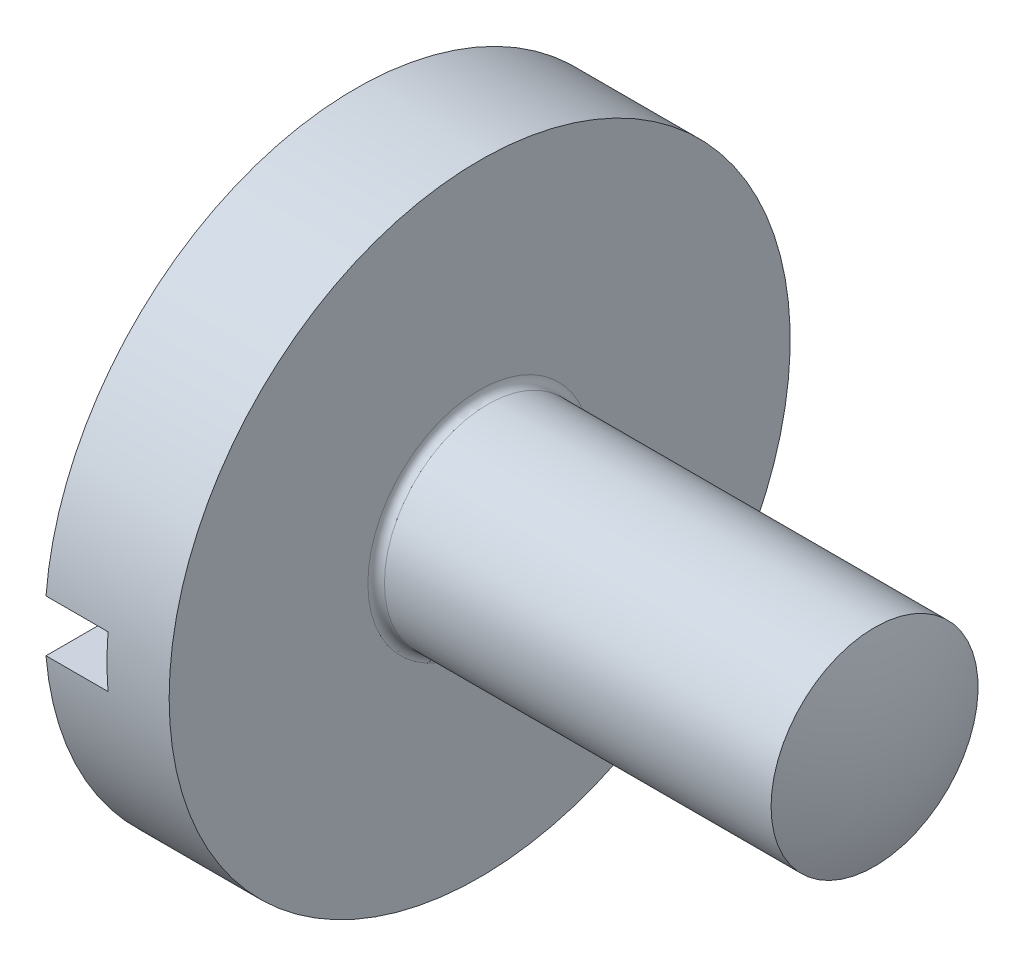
ISO-10303-21;
HEADER;
FILE_DESCRIPTION(('STEP AP214'),'2;1');
FILE_NAME('part.step','',(''),(''),'','','');
FILE_SCHEMA(('AUTOMOTIVE_DESIGN { 1 0 10303 214 1 1 1 1 }'));
ENDSEC;
DATA;
#1=APPLICATION_CONTEXT('core data for automotive mechanical design processes');
#2=APPLICATION_PROTOCOL_DEFINITION('international standard','automotive_design',2000,#1);
#3=PRODUCT_CONTEXT('',#1,'mechanical');
#4=PRODUCT('Part','Part','',(#3));
#5=PRODUCT_RELATED_PRODUCT_CATEGORY('part','',(#4));
#6=PRODUCT_DEFINITION_FORMATION('','',#4);
#7=PRODUCT_DEFINITION_CONTEXT('part definition',#1,'design');
#8=PRODUCT_DEFINITION('design','',#6,#7);
#9=PRODUCT_DEFINITION_SHAPE('','',#8);
#10=(LENGTH_UNIT() NAMED_UNIT(*) SI_UNIT(.MILLI.,.METRE.));
#11=(NAMED_UNIT(*) PLANE_ANGLE_UNIT() SI_UNIT($,.RADIAN.));
#12=(NAMED_UNIT(*) SI_UNIT($,.STERADIAN.) SOLID_ANGLE_UNIT());
#13=UNCERTAINTY_MEASURE_WITH_UNIT(LENGTH_MEASURE(1.E-05),#10,'distance_accuracy_value','');
#14=(GEOMETRIC_REPRESENTATION_CONTEXT(3) GLOBAL_UNCERTAINTY_ASSIGNED_CONTEXT((#13)) GLOBAL_UNIT_ASSIGNED_CONTEXT((#10,
#11,#12)) REPRESENTATION_CONTEXT('',''));
#15=CARTESIAN_POINT('',(0.,0.,0.));
#16=DIRECTION('',(0.,0.,1.));
#17=DIRECTION('',(1.,0.,0.));
#18=AXIS2_PLACEMENT_3D('',#15,#16,#17);
#19=CARTESIAN_POINT('',(0.,0.,0.));
#20=DIRECTION('',(1.,0.,0.));
#21=DIRECTION('',(0.,0.,-1.));
#22=AXIS2_PLACEMENT_3D('',#19,#20,#21);
#23=PLANE('',#22);
#24=CARTESIAN_POINT('',(0.,0.,0.));
#25=DIRECTION('',(-1.,0.,0.));
#26=DIRECTION('',(0.,0.,1.));
#27=AXIS2_PLACEMENT_3D('',#24,#25,#26);
#28=CIRCLE('',#27,15.);
#29=CARTESIAN_POINT('',(0.,1.25,14.9478259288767));
#30=VERTEX_POINT('',#29);
#31=CARTESIAN_POINT('',(0.,1.25,-14.9478259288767));
#32=VERTEX_POINT('',#31);
#33=EDGE_CURVE('E101',#30,#32,#28,.T.);
#34=ORIENTED_EDGE('',*,*,#33,.T.);
#35=DIRECTION('',(0.,0.,1.));
#36=VECTOR('',#35,1.);
#37=CARTESIAN_POINT('',(0.,1.25,0.));
#38=LINE('',#37,#36);
#39=EDGE_CURVE('E116',#32,#30,#38,.T.);
#40=ORIENTED_EDGE('',*,*,#39,.T.);
#41=EDGE_LOOP('',(#34,#40));
#42=FACE_BOUND('',#41,.T.);
#43=ADVANCED_FACE('F36',(#42),#23,.F.);
#44=CARTESIAN_POINT('',(12.,0.,0.));
#45=DIRECTION('',(-1.,0.,0.));
#46=DIRECTION('',(0.,1.,0.));
#47=AXIS2_PLACEMENT_3D('',#44,#45,#46);
#48=SPHERICAL_SURFACE('',#47,14.);
#49=CARTESIAN_POINT('',(25.076696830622,0.,0.));
#50=DIRECTION('',(-1.,0.,0.));
#51=DIRECTION('',(0.,0.,1.));
#52=AXIS2_PLACEMENT_3D('',#49,#50,#51);
#53=CIRCLE('',#52,5.);
#54=CARTESIAN_POINT('',(25.076696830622,0.,5.));
#55=VERTEX_POINT('',#54);
#56=EDGE_CURVE('E112',#55,#55,#53,.T.);
#57=ORIENTED_EDGE('',*,*,#56,.F.);
#58=EDGE_LOOP('',(#57));
#59=FACE_BOUND('',#58,.T.);
#60=ADVANCED_FACE('F38',(#59),#48,.T.);
#61=CARTESIAN_POINT('',(-64.3561797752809,0.,0.));
#62=DIRECTION('',(-1.,0.,0.));
#63=DIRECTION('',(0.,0.,1.));
#64=AXIS2_PLACEMENT_3D('',#61,#62,#63);
#65=CYLINDRICAL_SURFACE('',#64,5.);
#66=CARTESIAN_POINT('',(6.4,0.,0.));
#67=DIRECTION('',(-1.,0.,0.));
#68=DIRECTION('',(0.,0.,1.));
#69=AXIS2_PLACEMENT_3D('',#66,#67,#68);
#70=CIRCLE('',#69,5.);
#71=CARTESIAN_POINT('',(6.4,0.,5.));
#72=VERTEX_POINT('',#71);
#73=EDGE_CURVE('E109',#72,#72,#70,.T.);
#74=ORIENTED_EDGE('',*,*,#73,.F.);
#75=EDGE_LOOP('',(#74));
#76=FACE_BOUND('',#75,.T.);
#77=ORIENTED_EDGE('',*,*,#56,.T.);
#78=EDGE_LOOP('',(#77));
#79=FACE_BOUND('',#78,.T.);
#80=ADVANCED_FACE('F128',(#76,#79),#65,.T.);
#81=CARTESIAN_POINT('',(6.4,0.,0.));
#82=DIRECTION('',(-1.,0.,0.));
#83=DIRECTION('',(0.,0.,1.));
#84=AXIS2_PLACEMENT_3D('',#81,#82,#83);
#85=TOROIDAL_SURFACE('',#84,5.4,0.4);
#86=CARTESIAN_POINT('',(6.00000000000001,0.,0.));
#87=DIRECTION('',(-1.,0.,0.));
#88=DIRECTION('',(0.,0.,1.));
#89=AXIS2_PLACEMENT_3D('',#86,#87,#88);
#90=CIRCLE('',#89,5.4);
#91=CARTESIAN_POINT('',(6.00000000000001,0.,5.4));
#92=VERTEX_POINT('',#91);
#93=EDGE_CURVE('E106',#92,#92,#90,.T.);
#94=ORIENTED_EDGE('',*,*,#93,.F.);
#95=EDGE_LOOP('',(#94));
#96=FACE_BOUND('',#95,.T.);
#97=ORIENTED_EDGE('',*,*,#73,.T.);
#98=EDGE_LOOP('',(#97));
#99=FACE_BOUND('',#98,.T.);
#100=ADVANCED_FACE('F143',(#96,#99),#85,.F.);
#101=CARTESIAN_POINT('',(6.,15.,0.));
#102=DIRECTION('',(-1.,0.,0.));
#103=DIRECTION('',(0.,0.,1.));
#104=AXIS2_PLACEMENT_3D('',#101,#102,#103);
#105=PLANE('',#104);
#106=CARTESIAN_POINT('',(6.00000000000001,0.,0.));
#107=DIRECTION('',(-1.,0.,0.));
#108=DIRECTION('',(0.,0.,1.));
#109=AXIS2_PLACEMENT_3D('',#106,#107,#108);
#110=CIRCLE('',#109,15.);
#111=CARTESIAN_POINT('',(6.00000000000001,0.,15.));
#112=VERTEX_POINT('',#111);
#113=EDGE_CURVE('E102',#112,#112,#110,.T.);
#114=ORIENTED_EDGE('',*,*,#113,.F.);
#115=EDGE_LOOP('',(#114));
#116=FACE_BOUND('',#115,.T.);
#117=ORIENTED_EDGE('',*,*,#93,.T.);
#118=EDGE_LOOP('',(#117));
#119=FACE_BOUND('',#118,.T.);
#120=ADVANCED_FACE('F139',(#116,#119),#105,.F.);
#121=CARTESIAN_POINT('',(-64.3561797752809,0.,0.));
#122=DIRECTION('',(-1.,0.,0.));
#123=DIRECTION('',(0.,0.,1.));
#124=AXIS2_PLACEMENT_3D('',#121,#122,#123);
#125=CYLINDRICAL_SURFACE('',#124,15.);
#126=ORIENTED_EDGE('',*,*,#33,.F.);
#127=DIRECTION('',(-1.,0.,0.));
#128=VECTOR('',#127,1.);
#129=CARTESIAN_POINT('',(-64.3561797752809,1.25,14.9478259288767));
#130=LINE('',#129,#128);
#131=CARTESIAN_POINT('',(3.,1.25,14.9478259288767));
#132=VERTEX_POINT('',#131);
#133=EDGE_CURVE('E92',#30,#132,#130,.F.);
#134=ORIENTED_EDGE('',*,*,#133,.T.);
#135=CARTESIAN_POINT('',(3.,0.,0.));
#136=DIRECTION('',(1.,0.,0.));
#137=DIRECTION('',(0.,1.,0.));
#138=AXIS2_PLACEMENT_3D('',#135,#136,#137);
#139=CIRCLE('',#138,15.);
#140=CARTESIAN_POINT('',(3.,-1.25,14.9478259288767));
#141=VERTEX_POINT('',#140);
#142=EDGE_CURVE('E40',#132,#141,#139,.T.);
#143=ORIENTED_EDGE('',*,*,#142,.T.);
#144=DIRECTION('',(-1.,0.,0.));
#145=VECTOR('',#144,1.);
#146=CARTESIAN_POINT('',(-64.3561797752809,-1.25000000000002,14.9478259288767));
#147=LINE('',#146,#145);
#148=CARTESIAN_POINT('',(0.,-1.25,14.9478259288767));
#149=VERTEX_POINT('',#148);
#150=EDGE_CURVE('E83',#141,#149,#147,.T.);
#151=ORIENTED_EDGE('',*,*,#150,.T.);
#152=CARTESIAN_POINT('',(0.,-1.25,-14.9478259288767));
#153=VERTEX_POINT('',#152);
#154=EDGE_CURVE('E90',#153,#149,#28,.T.);
#155=ORIENTED_EDGE('',*,*,#154,.F.);
#156=DIRECTION('',(-1.,0.,0.));
#157=VECTOR('',#156,1.);
#158=CARTESIAN_POINT('',(-64.3561797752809,-1.25000000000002,-14.9478259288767));
#159=LINE('',#158,#157);
#160=CARTESIAN_POINT('',(3.,-1.25,-14.9478259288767));
#161=VERTEX_POINT('',#160);
#162=EDGE_CURVE('E51',#153,#161,#159,.F.);
#163=ORIENTED_EDGE('',*,*,#162,.T.);
#164=CARTESIAN_POINT('',(3.,1.25,-14.9478259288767));
#165=VERTEX_POINT('',#164);
#166=EDGE_CURVE('E11',#161,#165,#139,.T.);
#167=ORIENTED_EDGE('',*,*,#166,.T.);
#168=DIRECTION('',(-1.,0.,0.));
#169=VECTOR('',#168,1.);
#170=CARTESIAN_POINT('',(-64.3561797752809,1.25,-14.9478259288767));
#171=LINE('',#170,#169);
#172=EDGE_CURVE('E98',#165,#32,#171,.T.);
#173=ORIENTED_EDGE('',*,*,#172,.T.);
#174=EDGE_LOOP('',(#126,#134,#143,#151,#155,#163,#167,#173));
#175=FACE_BOUND('',#174,.T.);
#176=ORIENTED_EDGE('',*,*,#113,.T.);
#177=EDGE_LOOP('',(#176));
#178=FACE_BOUND('',#177,.T.);
#179=ADVANCED_FACE('F87',(#175,#178),#125,.T.);
#180=ORIENTED_EDGE('',*,*,#154,.T.);
#181=DIRECTION('',(0.,0.,-1.));
#182=VECTOR('',#181,1.);
#183=CARTESIAN_POINT('',(0.,-1.25,0.));
#184=LINE('',#183,#182);
#185=EDGE_CURVE('E115',#149,#153,#184,.T.);
#186=ORIENTED_EDGE('',*,*,#185,.T.);
#187=EDGE_LOOP('',(#180,#186));
#188=FACE_BOUND('',#187,.T.);
#189=ADVANCED_FACE('F124',(#188),#23,.F.);
#190=CARTESIAN_POINT('',(3.,1.25,-15.));
#191=DIRECTION('',(1.,0.,0.));
#192=DIRECTION('',(0.,1.,0.));
#193=AXIS2_PLACEMENT_3D('',#190,#191,#192);
#194=PLANE('',#193);
#195=DIRECTION('',(0.,0.,1.));
#196=VECTOR('',#195,1.);
#197=CARTESIAN_POINT('',(3.,1.25,-15.));
#198=LINE('',#197,#196);
#199=EDGE_CURVE('E78',#165,#132,#198,.T.);
#200=ORIENTED_EDGE('',*,*,#199,.F.);
#201=ORIENTED_EDGE('',*,*,#166,.F.);
#202=DIRECTION('',(0.,0.,1.));
#203=VECTOR('',#202,1.);
#204=CARTESIAN_POINT('',(3.,-1.25,-15.));
#205=LINE('',#204,#203);
#206=EDGE_CURVE('E77',#161,#141,#205,.T.);
#207=ORIENTED_EDGE('',*,*,#206,.T.);
#208=ORIENTED_EDGE('',*,*,#142,.F.);
#209=EDGE_LOOP('',(#200,#201,#207,#208));
#210=FACE_BOUND('',#209,.T.);
#211=ADVANCED_FACE('F76',(#210),#194,.F.);
#212=CARTESIAN_POINT('',(0.,1.25,-15.));
#213=DIRECTION('',(0.,1.,0.));
#214=DIRECTION('',(-1.,0.,0.));
#215=AXIS2_PLACEMENT_3D('',#212,#213,#214);
#216=PLANE('',#215);
#217=ORIENTED_EDGE('',*,*,#199,.T.);
#218=ORIENTED_EDGE('',*,*,#133,.F.);
#219=ORIENTED_EDGE('',*,*,#39,.F.);
#220=ORIENTED_EDGE('',*,*,#172,.F.);
#221=EDGE_LOOP('',(#217,#218,#219,#220));
#222=FACE_BOUND('',#221,.T.);
#223=ADVANCED_FACE('F121',(#222),#216,.F.);
#224=CARTESIAN_POINT('',(0.,-1.25,-15.));
#225=DIRECTION('',(0.,-1.,0.));
#226=DIRECTION('',(1.,0.,0.));
#227=AXIS2_PLACEMENT_3D('',#224,#225,#226);
#228=PLANE('',#227);
#229=ORIENTED_EDGE('',*,*,#206,.F.);
#230=ORIENTED_EDGE('',*,*,#162,.F.);
#231=ORIENTED_EDGE('',*,*,#185,.F.);
#232=ORIENTED_EDGE('',*,*,#150,.F.);
#233=EDGE_LOOP('',(#229,#230,#231,#232));
#234=FACE_BOUND('',#233,.T.);
#235=ADVANCED_FACE('F81',(#234),#228,.F.);
#236=CLOSED_SHELL('',(#43,#60,#80,#100,#120,#179,#189,#211,#223,#235));
#237=MANIFOLD_SOLID_BREP('B2',#236);
#238=ADVANCED_BREP_SHAPE_REPRESENTATION('',(#18,#237),#14);
#239=SHAPE_DEFINITION_REPRESENTATION(#9,#238);
ENDSEC;
END-ISO-10303-21;
